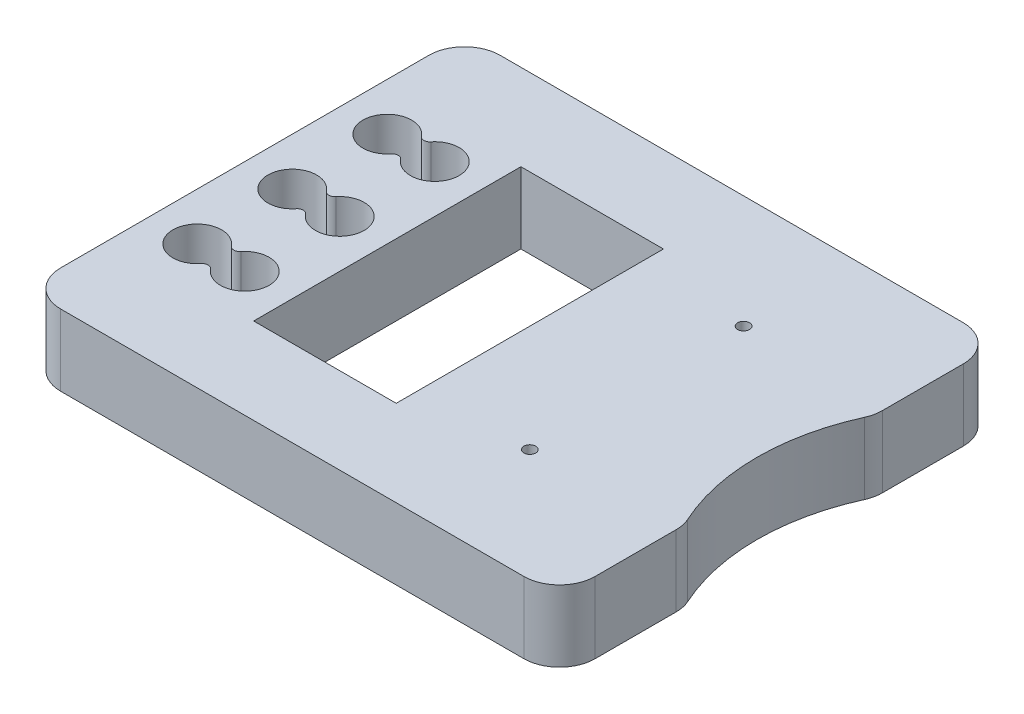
from build123d import *

# Parameters (mm, degrees)
ESQUISSE1_R        = 0.5
ESQUISSE1_W        = 12
ESQUISSE1_H        = 22.5
BOSS_EXTRU_1_DEPTH = 6
CONG_1_R           = 3
CONG_2_R           = 0.5


with BuildPart() as part:
    # Esquisse1 → Boss.-Extru.1 (new body)
    with BuildSketch(Plane(origin=(0, 0, 0), x_dir=(1, 0, 0), z_dir=(0, 1, 0))):
        with BuildLine():
            Line((0, 37), (0, 0))
            Line((0, 0), (45, 0))
            Line((45, 0), (45, 10.5))
            ThreePointArc((45, 10.5), (43.124515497, 18.5), (45, 26.5))
            Line((45, 26.5), (45, 37))
            Line((45, 37), (0, 37))
        make_face()
        with BuildLine():
            ThreePointArc((6, 10.05), (1.95, 10.5), (6, 10.95))
            ThreePointArc((6, 10.95), (10.05, 10.5), (6, 10.05))
        make_face(mode=Mode.SUBTRACT)
        with Locations(Location((33, 9.5, 0), (0, 0, 270))):
            Circle(ESQUISSE1_R, mode=Mode.SUBTRACT)
        with BuildLine():
            ThreePointArc((6, 18.05), (1.95, 18.5), (6, 18.95))
            ThreePointArc((6, 18.95), (10.05, 18.5), (6, 18.05))
        make_face(mode=Mode.SUBTRACT)
        with BuildLine():
            ThreePointArc((6, 26.05), (1.95, 26.5), (6, 26.95))
            ThreePointArc((6, 26.95), (10.05, 26.5), (6, 26.05))
        make_face(mode=Mode.SUBTRACT)
        with Locations((18, 18.5)):
            Rectangle(ESQUISSE1_W, ESQUISSE1_H, mode=Mode.SUBTRACT)
        with Locations(Location((33, 27.5, 0), (0, 0, 270))):
            Circle(ESQUISSE1_R, mode=Mode.SUBTRACT)
    extrude(amount=BOSS_EXTRU_1_DEPTH)

    # Cong_1
    cong_1_edges = [part.edges().sort_by_distance(p)[0] for p in [
        (45, 3, -10.5),
        (45, 3, 0),
        (0, 3, 0),
        (0, 3, -37),
        (45, 3, -37),
        (45, 3, -26.5),
    ]]
    fillet(cong_1_edges, radius=CONG_1_R)

    # Cong_2
    cong_2_edges = [part.edges().sort_by_distance(p)[0] for p in [
        (6, 3, -10.95),
        (6, 3, -10.05),
        (6, 3, -18.95),
        (6, 3, -18.05),
        (6, 3, -26.95),
        (6, 3, -26.05),
    ]]
    fillet(cong_2_edges, radius=CONG_2_R)


solid = part.part
